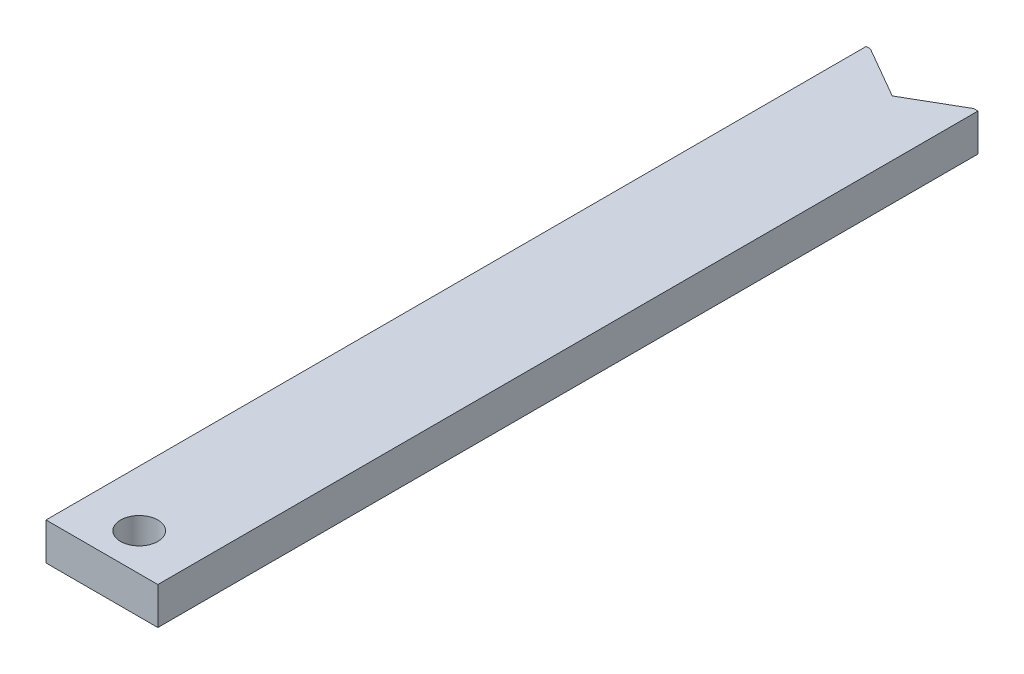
ISO-10303-21;
HEADER;
FILE_DESCRIPTION(('STEP AP214'),'2;1');
FILE_NAME('part.step','',(''),(''),'','','');
FILE_SCHEMA(('AUTOMOTIVE_DESIGN { 1 0 10303 214 1 1 1 1 }'));
ENDSEC;
DATA;
#1=APPLICATION_CONTEXT('core data for automotive mechanical design processes');
#2=APPLICATION_PROTOCOL_DEFINITION('international standard','automotive_design',2000,#1);
#3=PRODUCT_CONTEXT('',#1,'mechanical');
#4=PRODUCT('Part','Part','',(#3));
#5=PRODUCT_RELATED_PRODUCT_CATEGORY('part','',(#4));
#6=PRODUCT_DEFINITION_FORMATION('','',#4);
#7=PRODUCT_DEFINITION_CONTEXT('part definition',#1,'design');
#8=PRODUCT_DEFINITION('design','',#6,#7);
#9=PRODUCT_DEFINITION_SHAPE('','',#8);
#10=(LENGTH_UNIT() NAMED_UNIT(*) SI_UNIT(.MILLI.,.METRE.));
#11=(NAMED_UNIT(*) PLANE_ANGLE_UNIT() SI_UNIT($,.RADIAN.));
#12=(NAMED_UNIT(*) SI_UNIT($,.STERADIAN.) SOLID_ANGLE_UNIT());
#13=UNCERTAINTY_MEASURE_WITH_UNIT(LENGTH_MEASURE(1.E-05),#10,'distance_accuracy_value','');
#14=(GEOMETRIC_REPRESENTATION_CONTEXT(3) GLOBAL_UNCERTAINTY_ASSIGNED_CONTEXT((#13)) GLOBAL_UNIT_ASSIGNED_CONTEXT((#10,
#11,#12)) REPRESENTATION_CONTEXT('',''));
#15=CARTESIAN_POINT('',(0.,0.,0.));
#16=DIRECTION('',(0.,0.,1.));
#17=DIRECTION('',(1.,0.,0.));
#18=AXIS2_PLACEMENT_3D('',#15,#16,#17);
#19=CARTESIAN_POINT('',(-7.50000000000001,5.,-55.));
#20=DIRECTION('',(0.,0.,1.));
#21=DIRECTION('',(1.,0.,0.));
#22=AXIS2_PLACEMENT_3D('',#19,#20,#21);
#23=PLANE('',#22);
#24=DIRECTION('',(0.,1.,0.));
#25=VECTOR('',#24,1.);
#26=CARTESIAN_POINT('',(-6.92820323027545,0.,-55.));
#27=LINE('',#26,#25);
#28=CARTESIAN_POINT('',(-6.92820323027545,5.,-55.));
#29=VERTEX_POINT('',#28);
#30=CARTESIAN_POINT('',(-6.92820323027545,0.,-55.));
#31=VERTEX_POINT('',#30);
#32=EDGE_CURVE('E71',#29,#31,#27,.F.);
#33=ORIENTED_EDGE('',*,*,#32,.T.);
#34=DIRECTION('',(1.,0.,0.));
#35=VECTOR('',#34,1.);
#36=CARTESIAN_POINT('',(0.,0.,-55.));
#37=LINE('',#36,#35);
#38=CARTESIAN_POINT('',(-7.50000000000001,0.,-55.));
#39=VERTEX_POINT('',#38);
#40=EDGE_CURVE('E85',#31,#39,#37,.F.);
#41=ORIENTED_EDGE('',*,*,#40,.T.);
#42=DIRECTION('',(0.,1.,0.));
#43=VECTOR('',#42,1.);
#44=CARTESIAN_POINT('',(-7.50000000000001,5.,-55.));
#45=LINE('',#44,#43);
#46=CARTESIAN_POINT('',(-7.50000000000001,5.,-55.));
#47=VERTEX_POINT('',#46);
#48=EDGE_CURVE('E128',#39,#47,#45,.T.);
#49=ORIENTED_EDGE('',*,*,#48,.T.);
#50=DIRECTION('',(1.,0.,0.));
#51=VECTOR('',#50,1.);
#52=CARTESIAN_POINT('',(-7.50000000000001,5.,-55.));
#53=LINE('',#52,#51);
#54=EDGE_CURVE('E105',#29,#47,#53,.F.);
#55=ORIENTED_EDGE('',*,*,#54,.F.);
#56=EDGE_LOOP('',(#33,#41,#49,#55));
#57=FACE_BOUND('',#56,.T.);
#58=ADVANCED_FACE('F17',(#57),#23,.F.);
#59=CARTESIAN_POINT('',(-7.50000000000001,5.,-55.));
#60=DIRECTION('',(0.,0.,1.));
#61=DIRECTION('',(1.,0.,0.));
#62=AXIS2_PLACEMENT_3D('',#59,#60,#61);
#63=PLANE('',#62);
#64=DIRECTION('',(0.,1.,0.));
#65=VECTOR('',#64,1.);
#66=CARTESIAN_POINT('',(6.92820323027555,0.,-55.));
#67=LINE('',#66,#65);
#68=CARTESIAN_POINT('',(6.92820323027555,0.,-55.));
#69=VERTEX_POINT('',#68);
#70=CARTESIAN_POINT('',(6.92820323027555,5.,-55.));
#71=VERTEX_POINT('',#70);
#72=EDGE_CURVE('E79',#69,#71,#67,.T.);
#73=ORIENTED_EDGE('',*,*,#72,.T.);
#74=DIRECTION('',(1.,0.,0.));
#75=VECTOR('',#74,1.);
#76=CARTESIAN_POINT('',(-7.50000000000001,5.,-55.));
#77=LINE('',#76,#75);
#78=CARTESIAN_POINT('',(7.5,5.,-55.));
#79=VERTEX_POINT('',#78);
#80=EDGE_CURVE('E35',#79,#71,#77,.F.);
#81=ORIENTED_EDGE('',*,*,#80,.F.);
#82=DIRECTION('',(0.,1.,0.));
#83=VECTOR('',#82,1.);
#84=CARTESIAN_POINT('',(7.49999999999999,5.,-55.));
#85=LINE('',#84,#83);
#86=CARTESIAN_POINT('',(7.5,0.,-55.));
#87=VERTEX_POINT('',#86);
#88=EDGE_CURVE('E81',#79,#87,#85,.F.);
#89=ORIENTED_EDGE('',*,*,#88,.T.);
#90=DIRECTION('',(1.,0.,0.));
#91=VECTOR('',#90,1.);
#92=CARTESIAN_POINT('',(0.,0.,-55.));
#93=LINE('',#92,#91);
#94=EDGE_CURVE('E75',#87,#69,#93,.F.);
#95=ORIENTED_EDGE('',*,*,#94,.T.);
#96=EDGE_LOOP('',(#73,#81,#89,#95));
#97=FACE_BOUND('',#96,.T.);
#98=ADVANCED_FACE('F77',(#97),#63,.F.);
#99=CARTESIAN_POINT('',(0.,0.,0.));
#100=DIRECTION('',(0.,1.,0.));
#101=DIRECTION('',(0.,0.,1.));
#102=AXIS2_PLACEMENT_3D('',#99,#100,#101);
#103=PLANE('',#102);
#104=DIRECTION('',(0.86602540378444,0.,-0.499999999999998));
#105=VECTOR('',#104,1.);
#106=CARTESIAN_POINT('',(0.,0.,-51.));
#107=LINE('',#106,#105);
#108=CARTESIAN_POINT('',(0.,0.,-51.));
#109=VERTEX_POINT('',#108);
#110=EDGE_CURVE('E88',#109,#69,#107,.T.);
#111=ORIENTED_EDGE('',*,*,#110,.T.);
#112=ORIENTED_EDGE('',*,*,#94,.F.);
#113=DIRECTION('',(0.,0.,1.));
#114=VECTOR('',#113,1.);
#115=CARTESIAN_POINT('',(7.49999999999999,0.,-55.));
#116=LINE('',#115,#114);
#117=CARTESIAN_POINT('',(7.50000000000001,0.,55.));
#118=VERTEX_POINT('',#117);
#119=EDGE_CURVE('E108',#87,#118,#116,.T.);
#120=ORIENTED_EDGE('',*,*,#119,.T.);
#121=DIRECTION('',(-1.,0.,0.));
#122=VECTOR('',#121,1.);
#123=CARTESIAN_POINT('',(-7.49999999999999,0.,55.));
#124=LINE('',#123,#122);
#125=CARTESIAN_POINT('',(-7.5,0.,55.));
#126=VERTEX_POINT('',#125);
#127=EDGE_CURVE('E121',#118,#126,#124,.T.);
#128=ORIENTED_EDGE('',*,*,#127,.T.);
#129=DIRECTION('',(0.,0.,-1.));
#130=VECTOR('',#129,1.);
#131=CARTESIAN_POINT('',(-7.50000000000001,0.,-55.));
#132=LINE('',#131,#130);
#133=EDGE_CURVE('E125',#126,#39,#132,.T.);
#134=ORIENTED_EDGE('',*,*,#133,.T.);
#135=ORIENTED_EDGE('',*,*,#40,.F.);
#136=DIRECTION('',(0.866025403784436,0.,0.500000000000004));
#137=VECTOR('',#136,1.);
#138=CARTESIAN_POINT('',(-6.92820323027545,0.,-55.));
#139=LINE('',#138,#137);
#140=EDGE_CURVE('E92',#31,#109,#139,.T.);
#141=ORIENTED_EDGE('',*,*,#140,.T.);
#142=EDGE_LOOP('',(#111,#112,#120,#128,#134,#135,#141));
#143=FACE_BOUND('',#142,.T.);
#144=CARTESIAN_POINT('',(0.,0.,50.));
#145=DIRECTION('',(0.,1.,0.));
#146=DIRECTION('',(0.,0.,1.));
#147=AXIS2_PLACEMENT_3D('',#144,#145,#146);
#148=CIRCLE('',#147,2.5);
#149=CARTESIAN_POINT('',(0.,0.,52.5));
#150=VERTEX_POINT('',#149);
#151=EDGE_CURVE('E20',#150,#150,#148,.T.);
#152=ORIENTED_EDGE('',*,*,#151,.T.);
#153=EDGE_LOOP('',(#152));
#154=FACE_BOUND('',#153,.T.);
#155=ADVANCED_FACE('F89',(#143,#154),#103,.F.);
#156=CARTESIAN_POINT('',(0.,0.,50.));
#157=DIRECTION('',(0.,1.,0.));
#158=DIRECTION('',(0.,0.,1.));
#159=AXIS2_PLACEMENT_3D('',#156,#157,#158);
#160=CYLINDRICAL_SURFACE('',#159,2.5);
#161=CARTESIAN_POINT('',(0.,5.,50.));
#162=DIRECTION('',(0.,1.,0.));
#163=DIRECTION('',(0.,0.,1.));
#164=AXIS2_PLACEMENT_3D('',#161,#162,#163);
#165=CIRCLE('',#164,2.5);
#166=CARTESIAN_POINT('',(0.,5.,52.5));
#167=VERTEX_POINT('',#166);
#168=EDGE_CURVE('E106',#167,#167,#165,.F.);
#169=ORIENTED_EDGE('',*,*,#168,.F.);
#170=EDGE_LOOP('',(#169));
#171=FACE_BOUND('',#170,.T.);
#172=ORIENTED_EDGE('',*,*,#151,.F.);
#173=EDGE_LOOP('',(#172));
#174=FACE_BOUND('',#173,.T.);
#175=ADVANCED_FACE('F174',(#171,#174),#160,.F.);
#176=CARTESIAN_POINT('',(0.,0.,-51.));
#177=DIRECTION('',(0.499999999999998,0.,0.86602540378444));
#178=DIRECTION('',(0.86602540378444,0.,-0.499999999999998));
#179=AXIS2_PLACEMENT_3D('',#176,#177,#178);
#180=PLANE('',#179);
#181=ORIENTED_EDGE('',*,*,#72,.F.);
#182=ORIENTED_EDGE('',*,*,#110,.F.);
#183=DIRECTION('',(0.,1.,0.));
#184=VECTOR('',#183,1.);
#185=CARTESIAN_POINT('',(0.,0.,-51.));
#186=LINE('',#185,#184);
#187=CARTESIAN_POINT('',(0.,5.,-51.));
#188=VERTEX_POINT('',#187);
#189=EDGE_CURVE('E131',#109,#188,#186,.T.);
#190=ORIENTED_EDGE('',*,*,#189,.T.);
#191=DIRECTION('',(-0.86602540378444,0.,0.499999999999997));
#192=VECTOR('',#191,1.);
#193=CARTESIAN_POINT('',(6.92820323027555,5.,-55.));
#194=LINE('',#193,#192);
#195=EDGE_CURVE('E98',#71,#188,#194,.T.);
#196=ORIENTED_EDGE('',*,*,#195,.F.);
#197=EDGE_LOOP('',(#181,#182,#190,#196));
#198=FACE_BOUND('',#197,.T.);
#199=ADVANCED_FACE('F96',(#198),#180,.F.);
#200=CARTESIAN_POINT('',(-6.92820323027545,0.,-55.));
#201=DIRECTION('',(-0.500000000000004,0.,0.866025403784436));
#202=DIRECTION('',(0.866025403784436,0.,0.500000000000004));
#203=AXIS2_PLACEMENT_3D('',#200,#201,#202);
#204=PLANE('',#203);
#205=ORIENTED_EDGE('',*,*,#189,.F.);
#206=ORIENTED_EDGE('',*,*,#140,.F.);
#207=ORIENTED_EDGE('',*,*,#32,.F.);
#208=DIRECTION('',(-0.866025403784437,0.,-0.500000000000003));
#209=VECTOR('',#208,1.);
#210=CARTESIAN_POINT('',(0.,5.,-51.));
#211=LINE('',#210,#209);
#212=EDGE_CURVE('E111',#188,#29,#211,.T.);
#213=ORIENTED_EDGE('',*,*,#212,.F.);
#214=EDGE_LOOP('',(#205,#206,#207,#213));
#215=FACE_BOUND('',#214,.T.);
#216=ADVANCED_FACE('F135',(#215),#204,.F.);
#217=CARTESIAN_POINT('',(-7.50000000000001,5.,-55.));
#218=DIRECTION('',(1.,0.,0.));
#219=DIRECTION('',(0.,0.,-1.));
#220=AXIS2_PLACEMENT_3D('',#217,#218,#219);
#221=PLANE('',#220);
#222=DIRECTION('',(0.,1.,0.));
#223=VECTOR('',#222,1.);
#224=CARTESIAN_POINT('',(-7.49999999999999,5.,55.));
#225=LINE('',#224,#223);
#226=CARTESIAN_POINT('',(-7.5,5.,55.));
#227=VERTEX_POINT('',#226);
#228=EDGE_CURVE('E123',#126,#227,#225,.T.);
#229=ORIENTED_EDGE('',*,*,#228,.T.);
#230=DIRECTION('',(0.,0.,1.));
#231=VECTOR('',#230,1.);
#232=CARTESIAN_POINT('',(-7.50000000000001,5.,0.));
#233=LINE('',#232,#231);
#234=EDGE_CURVE('E137',#47,#227,#233,.T.);
#235=ORIENTED_EDGE('',*,*,#234,.F.);
#236=ORIENTED_EDGE('',*,*,#48,.F.);
#237=ORIENTED_EDGE('',*,*,#133,.F.);
#238=EDGE_LOOP('',(#229,#235,#236,#237));
#239=FACE_BOUND('',#238,.T.);
#240=ADVANCED_FACE('F151',(#239),#221,.F.);
#241=CARTESIAN_POINT('',(-7.49999999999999,5.,55.));
#242=DIRECTION('',(0.,0.,-1.));
#243=DIRECTION('',(-1.,0.,0.));
#244=AXIS2_PLACEMENT_3D('',#241,#242,#243);
#245=PLANE('',#244);
#246=DIRECTION('',(0.,1.,0.));
#247=VECTOR('',#246,1.);
#248=CARTESIAN_POINT('',(7.50000000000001,5.,55.));
#249=LINE('',#248,#247);
#250=CARTESIAN_POINT('',(7.50000000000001,5.,55.));
#251=VERTEX_POINT('',#250);
#252=EDGE_CURVE('E116',#118,#251,#249,.T.);
#253=ORIENTED_EDGE('',*,*,#252,.T.);
#254=DIRECTION('',(1.,0.,0.));
#255=VECTOR('',#254,1.);
#256=CARTESIAN_POINT('',(0.,5.,55.));
#257=LINE('',#256,#255);
#258=EDGE_CURVE('E26',#227,#251,#257,.T.);
#259=ORIENTED_EDGE('',*,*,#258,.F.);
#260=ORIENTED_EDGE('',*,*,#228,.F.);
#261=ORIENTED_EDGE('',*,*,#127,.F.);
#262=EDGE_LOOP('',(#253,#259,#260,#261));
#263=FACE_BOUND('',#262,.T.);
#264=ADVANCED_FACE('F146',(#263),#245,.F.);
#265=CARTESIAN_POINT('',(7.49999999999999,5.,-55.));
#266=DIRECTION('',(-1.,0.,0.));
#267=DIRECTION('',(0.,0.,1.));
#268=AXIS2_PLACEMENT_3D('',#265,#266,#267);
#269=PLANE('',#268);
#270=ORIENTED_EDGE('',*,*,#88,.F.);
#271=DIRECTION('',(0.,0.,1.));
#272=VECTOR('',#271,1.);
#273=CARTESIAN_POINT('',(7.50000000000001,5.,0.));
#274=LINE('',#273,#272);
#275=EDGE_CURVE('E11',#251,#79,#274,.F.);
#276=ORIENTED_EDGE('',*,*,#275,.F.);
#277=ORIENTED_EDGE('',*,*,#252,.F.);
#278=ORIENTED_EDGE('',*,*,#119,.F.);
#279=EDGE_LOOP('',(#270,#276,#277,#278));
#280=FACE_BOUND('',#279,.T.);
#281=ADVANCED_FACE('F144',(#280),#269,.F.);
#282=CARTESIAN_POINT('',(0.,5.,0.));
#283=DIRECTION('',(0.,1.,0.));
#284=DIRECTION('',(0.,0.,1.));
#285=AXIS2_PLACEMENT_3D('',#282,#283,#284);
#286=PLANE('',#285);
#287=ORIENTED_EDGE('',*,*,#275,.T.);
#288=ORIENTED_EDGE('',*,*,#80,.T.);
#289=ORIENTED_EDGE('',*,*,#195,.T.);
#290=ORIENTED_EDGE('',*,*,#212,.T.);
#291=ORIENTED_EDGE('',*,*,#54,.T.);
#292=ORIENTED_EDGE('',*,*,#234,.T.);
#293=ORIENTED_EDGE('',*,*,#258,.T.);
#294=EDGE_LOOP('',(#287,#288,#289,#290,#291,#292,#293));
#295=FACE_BOUND('',#294,.T.);
#296=ORIENTED_EDGE('',*,*,#168,.T.);
#297=EDGE_LOOP('',(#296));
#298=FACE_BOUND('',#297,.T.);
#299=ADVANCED_FACE('F138',(#295,#298),#286,.T.);
#300=CLOSED_SHELL('',(#58,#98,#155,#175,#199,#216,#240,#264,#281,#299));
#301=MANIFOLD_SOLID_BREP('B1',#300);
#302=ADVANCED_BREP_SHAPE_REPRESENTATION('',(#18,#301),#14);
#303=SHAPE_DEFINITION_REPRESENTATION(#9,#302);
ENDSEC;
END-ISO-10303-21;
